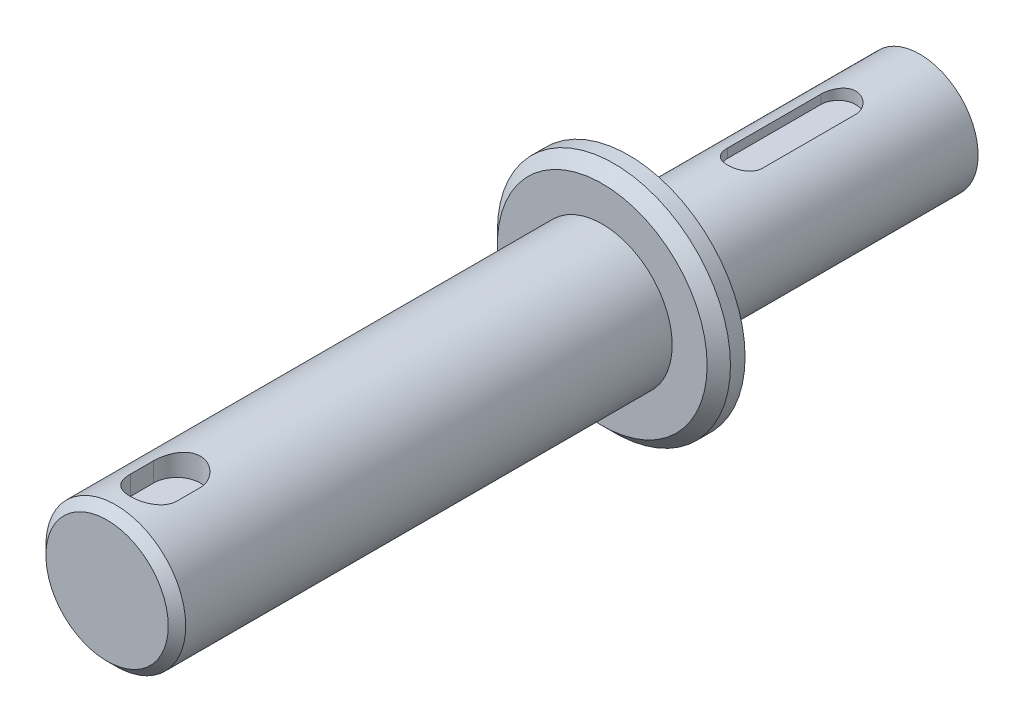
from build123d import *

# Parameters (mm, degrees)
ESQUISSE1_R             = 20
BASE_EXTRUSION_DEPTH    = 4.51
CHANFREIN1_SIZE         = 2
ESQUISSE2_R             = 12
BOSS_EXTRU_1_DEPTH      = 85
CHANFREIN2_SIZE         = 1.5
ENL_V_MAT_EXTRU_1_DEPTH = 96.895985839
ESQUISSE4_R             = 10
BOSS_EXTRU_2_DEPTH      = 50
ENL_V_MAT_EXTRU_2_DEPTH = 2


with BuildPart() as part:
    # Esquisse1 → Base-Extrusion (new body)
    with BuildSketch(Plane.XY):
        Circle(ESQUISSE1_R)
    extrude(amount=BASE_EXTRUSION_DEPTH)

    # Chanfrein1
    chanfrein1_edges = [part.edges().sort_by_distance(p)[0] for p in [
        (-20, 0, 4.51),
    ]]
    chamfer(chanfrein1_edges, length=CHANFREIN1_SIZE)

    # Esquisse2 → Boss.-Extru.1 (add)
    with BuildSketch(Plane.XY.offset(4.51)):
        Circle(ESQUISSE2_R)
    extrude(amount=BOSS_EXTRU_1_DEPTH)

    # Chanfrein2
    chanfrein2_edges = [part.edges().sort_by_distance(p)[0] for p in [
        (-12, 0, 89.51),
    ]]
    chamfer(chanfrein2_edges, length=CHANFREIN2_SIZE)

    # Esquisse3 → Enl_v. mat.-Extru.1 (cut, through all)
    with BuildSketch(Plane(origin=(0, 8, 0), x_dir=(1, 0, 0), z_dir=(0, 1, 0))):
        with BuildLine():
            Line((4, -77.51), (4, -81.51))
            ThreePointArc((4, -81.51), (0, -85.51), (-4, -81.51))
            Line((-4, -81.51), (-4, -77.51))
            ThreePointArc((-4, -77.51), (0, -73.51), (4, -77.51))
        make_face()
    extrude(amount=ENL_V_MAT_EXTRU_1_DEPTH, mode=Mode.SUBTRACT)

    # Esquisse4 → Boss.-Extru.2 (add)
    with BuildSketch(Plane(origin=(0, 0, 0), x_dir=(-1, 0, 0), z_dir=(0, 0, -1))):
        Circle(ESQUISSE4_R)
    extrude(amount=BOSS_EXTRU_2_DEPTH)

    # Esquisse5 → Enl_v. mat.-Extru.2 (cut)
    with BuildSketch(Plane(origin=(0, 10, 0), x_dir=(1, 0, 0), z_dir=(0, 1, 0))):
        with BuildLine():
            Line((-3, 20), (-3, 36))
            ThreePointArc((-3, 36), (0, 39), (3, 36))
            Line((3, 36), (3, 20))
            ThreePointArc((3, 20), (0, 17), (-3, 20))
        make_face()
    extrude(amount=-ENL_V_MAT_EXTRU_2_DEPTH, mode=Mode.SUBTRACT)


solid = part.part
